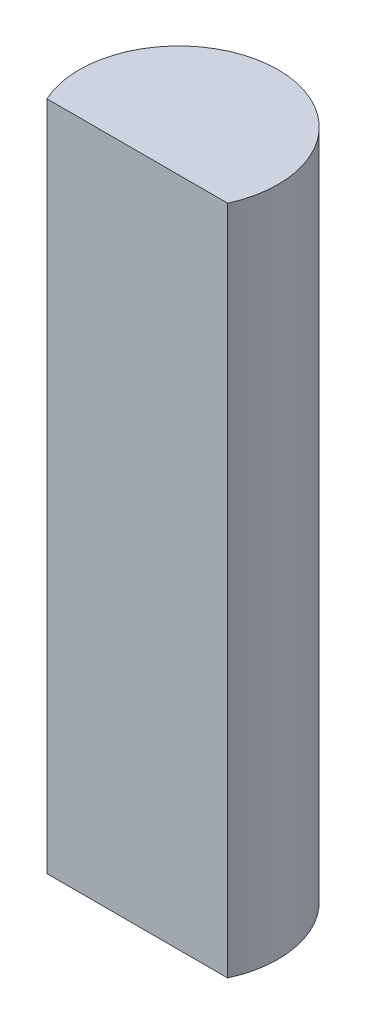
from build123d import *

# Parameters (mm, degrees)
BOSS_EXTRUDE1_DEPTH = 40.5


with BuildPart() as part:
    # Sketch1 → Boss-Extrude1 (new body)
    with BuildSketch(Plane(origin=(0, 0, 0), x_dir=(1, 0, 0), z_dir=(0, 1, 0))):
        with BuildLine():
            Line((-5.454356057, -2.5), (5.454356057, -2.5))
            ThreePointArc((5.454356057, -2.5), (0, 6), (-5.454356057, -2.5))
        make_face()
    extrude(amount=BOSS_EXTRUDE1_DEPTH)


solid = part.part
